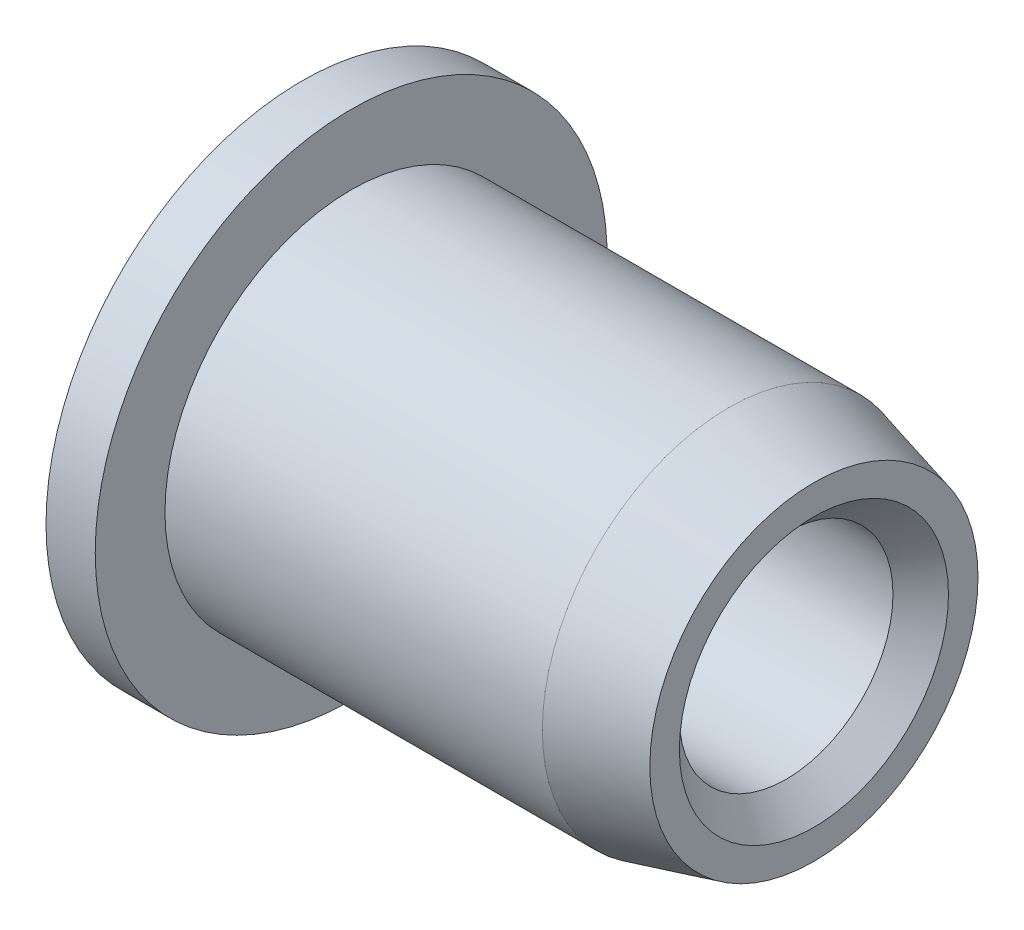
ISO-10303-21;
HEADER;
FILE_DESCRIPTION(('STEP AP214'),'2;1');
FILE_NAME('part.step','',(''),(''),'','','');
FILE_SCHEMA(('AUTOMOTIVE_DESIGN { 1 0 10303 214 1 1 1 1 }'));
ENDSEC;
DATA;
#1=APPLICATION_CONTEXT('core data for automotive mechanical design processes');
#2=APPLICATION_PROTOCOL_DEFINITION('international standard','automotive_design',2000,#1);
#3=PRODUCT_CONTEXT('',#1,'mechanical');
#4=PRODUCT('Part','Part','',(#3));
#5=PRODUCT_RELATED_PRODUCT_CATEGORY('part','',(#4));
#6=PRODUCT_DEFINITION_FORMATION('','',#4);
#7=PRODUCT_DEFINITION_CONTEXT('part definition',#1,'design');
#8=PRODUCT_DEFINITION('design','',#6,#7);
#9=PRODUCT_DEFINITION_SHAPE('','',#8);
#10=(LENGTH_UNIT() NAMED_UNIT(*) SI_UNIT(.MILLI.,.METRE.));
#11=(NAMED_UNIT(*) PLANE_ANGLE_UNIT() SI_UNIT($,.RADIAN.));
#12=(NAMED_UNIT(*) SI_UNIT($,.STERADIAN.) SOLID_ANGLE_UNIT());
#13=UNCERTAINTY_MEASURE_WITH_UNIT(LENGTH_MEASURE(1.E-05),#10,'distance_accuracy_value','');
#14=(GEOMETRIC_REPRESENTATION_CONTEXT(3) GLOBAL_UNCERTAINTY_ASSIGNED_CONTEXT((#13)) GLOBAL_UNIT_ASSIGNED_CONTEXT((#10,
#11,#12)) REPRESENTATION_CONTEXT('',''));
#15=CARTESIAN_POINT('',(0.,0.,0.));
#16=DIRECTION('',(0.,0.,1.));
#17=DIRECTION('',(1.,0.,0.));
#18=AXIS2_PLACEMENT_3D('',#15,#16,#17);
#19=CARTESIAN_POINT('',(7.49553999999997,0.,0.));
#20=DIRECTION('',(-1.,0.,0.));
#21=DIRECTION('',(0.,-1.,0.));
#22=AXIS2_PLACEMENT_3D('',#19,#20,#21);
#23=CYLINDRICAL_SURFACE('',#22,1.65354);
#24=CARTESIAN_POINT('',(0.429259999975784,0.,0.));
#25=DIRECTION('',(-1.,0.,0.));
#26=DIRECTION('',(0.,0.,1.));
#27=AXIS2_PLACEMENT_3D('',#24,#25,#26);
#28=CIRCLE('',#27,1.65354000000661);
#29=CARTESIAN_POINT('',(0.429259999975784,0.,1.65354000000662));
#30=VERTEX_POINT('',#29);
#31=EDGE_CURVE('E30',#30,#30,#28,.F.);
#32=ORIENTED_EDGE('',*,*,#31,.F.);
#33=EDGE_LOOP('',(#32));
#34=FACE_BOUND('',#33,.T.);
#35=CARTESIAN_POINT('',(7.49554000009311,0.,0.));
#36=DIRECTION('',(1.,0.,0.));
#37=DIRECTION('',(0.,0.,1.));
#38=AXIS2_PLACEMENT_3D('',#35,#36,#37);
#39=CIRCLE('',#38,1.65354000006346);
#40=CARTESIAN_POINT('',(7.49554000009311,0.,1.65354000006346));
#41=VERTEX_POINT('',#40);
#42=EDGE_CURVE('E44',#41,#41,#39,.F.);
#43=ORIENTED_EDGE('',*,*,#42,.F.);
#44=EDGE_LOOP('',(#43));
#45=FACE_BOUND('',#44,.T.);
#46=ADVANCED_FACE('F14',(#34,#45),#23,.F.);
#47=CARTESIAN_POINT('',(0.429260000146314,0.,0.));
#48=DIRECTION('',(-1.,0.,0.));
#49=DIRECTION('',(0.,-1.,0.));
#50=AXIS2_PLACEMENT_3D('',#47,#48,#49);
#51=CONICAL_SURFACE('',#50,1.65353999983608,0.785398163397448);
#52=ORIENTED_EDGE('',*,*,#31,.T.);
#53=EDGE_LOOP('',(#52));
#54=FACE_BOUND('',#53,.T.);
#55=CARTESIAN_POINT('',(5.6843418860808E-11,0.,0.));
#56=DIRECTION('',(-1.,0.,0.));
#57=DIRECTION('',(0.,-1.,0.));
#58=AXIS2_PLACEMENT_3D('',#55,#56,#57);
#59=CIRCLE('',#58,2.08279999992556);
#60=CARTESIAN_POINT('',(5.68436578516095E-11,-2.08279999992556,0.));
#61=VERTEX_POINT('',#60);
#62=EDGE_CURVE('E17',#61,#61,#59,.F.);
#63=ORIENTED_EDGE('',*,*,#62,.F.);
#64=EDGE_LOOP('',(#63));
#65=FACE_BOUND('',#64,.T.);
#66=ADVANCED_FACE('F53',(#54,#65),#51,.F.);
#67=CARTESIAN_POINT('',(7.49554000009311,0.,0.));
#68=DIRECTION('',(1.,0.,0.));
#69=DIRECTION('',(0.,0.,-1.));
#70=AXIS2_PLACEMENT_3D('',#67,#68,#69);
#71=CONICAL_SURFACE('',#70,1.65354000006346,0.785398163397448);
#72=ORIENTED_EDGE('',*,*,#42,.T.);
#73=EDGE_LOOP('',(#72));
#74=FACE_BOUND('',#73,.T.);
#75=CARTESIAN_POINT('',(7.9248000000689,0.,0.));
#76=DIRECTION('',(1.,0.,0.));
#77=DIRECTION('',(0.,0.,-1.));
#78=AXIS2_PLACEMENT_3D('',#75,#76,#77);
#79=CIRCLE('',#78,2.08280000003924);
#80=CARTESIAN_POINT('',(7.9248000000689,0.,-2.08280000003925));
#81=VERTEX_POINT('',#80);
#82=EDGE_CURVE('E39',#81,#81,#79,.F.);
#83=ORIENTED_EDGE('',*,*,#82,.F.);
#84=EDGE_LOOP('',(#83));
#85=FACE_BOUND('',#84,.T.);
#86=ADVANCED_FACE('F62',(#74,#85),#71,.F.);
#87=CARTESIAN_POINT('',(0.,0.,-1.98119999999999));
#88=DIRECTION('',(-1.,0.,0.));
#89=DIRECTION('',(0.,0.,1.));
#90=AXIS2_PLACEMENT_3D('',#87,#88,#89);
#91=PLANE('',#90);
#92=CARTESIAN_POINT('',(0.,0.,0.));
#93=DIRECTION('',(-1.,0.,0.));
#94=DIRECTION('',(0.,0.,1.));
#95=AXIS2_PLACEMENT_3D('',#92,#93,#94);
#96=CIRCLE('',#95,3.9624);
#97=CARTESIAN_POINT('',(0.,0.,3.96240000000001));
#98=VERTEX_POINT('',#97);
#99=EDGE_CURVE('E37',#98,#98,#96,.F.);
#100=ORIENTED_EDGE('',*,*,#99,.F.);
#101=EDGE_LOOP('',(#100));
#102=FACE_BOUND('',#101,.T.);
#103=ORIENTED_EDGE('',*,*,#62,.T.);
#104=EDGE_LOOP('',(#103));
#105=FACE_BOUND('',#104,.T.);
#106=ADVANCED_FACE('F85',(#102,#105),#91,.T.);
#107=CARTESIAN_POINT('',(7.92479999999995,0.,-1.27000000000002));
#108=DIRECTION('',(1.,0.,0.));
#109=DIRECTION('',(0.,1.,0.));
#110=AXIS2_PLACEMENT_3D('',#107,#108,#109);
#111=PLANE('',#110);
#112=CARTESIAN_POINT('',(7.9248000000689,0.,0.));
#113=DIRECTION('',(-1.,0.,0.));
#114=DIRECTION('',(0.,-1.,0.));
#115=AXIS2_PLACEMENT_3D('',#112,#113,#114);
#116=CIRCLE('',#115,2.53999999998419);
#117=CARTESIAN_POINT('',(7.9248000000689,-2.53999999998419,0.));
#118=VERTEX_POINT('',#117);
#119=EDGE_CURVE('E34',#118,#118,#116,.T.);
#120=ORIENTED_EDGE('',*,*,#119,.F.);
#121=EDGE_LOOP('',(#120));
#122=FACE_BOUND('',#121,.T.);
#123=ORIENTED_EDGE('',*,*,#82,.T.);
#124=EDGE_LOOP('',(#123));
#125=FACE_BOUND('',#124,.T.);
#126=ADVANCED_FACE('F81',(#122,#125),#111,.T.);
#127=CARTESIAN_POINT('',(0.380999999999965,0.,0.));
#128=DIRECTION('',(-1.,0.,0.));
#129=DIRECTION('',(0.,0.,1.));
#130=AXIS2_PLACEMENT_3D('',#127,#128,#129);
#131=CYLINDRICAL_SURFACE('',#130,3.9624);
#132=ORIENTED_EDGE('',*,*,#99,.T.);
#133=EDGE_LOOP('',(#132));
#134=FACE_BOUND('',#133,.T.);
#135=CARTESIAN_POINT('',(0.76200000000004,0.,0.));
#136=DIRECTION('',(-1.,0.,0.));
#137=DIRECTION('',(0.,0.,1.));
#138=AXIS2_PLACEMENT_3D('',#135,#136,#137);
#139=CIRCLE('',#138,3.9624);
#140=CARTESIAN_POINT('',(0.76200000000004,0.,3.96240000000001));
#141=VERTEX_POINT('',#140);
#142=EDGE_CURVE('E26',#141,#141,#139,.F.);
#143=ORIENTED_EDGE('',*,*,#142,.F.);
#144=EDGE_LOOP('',(#143));
#145=FACE_BOUND('',#144,.T.);
#146=ADVANCED_FACE('F77',(#134,#145),#131,.T.);
#147=CARTESIAN_POINT('',(6.60400000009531,0.,0.));
#148=DIRECTION('',(-1.,0.,0.));
#149=DIRECTION('',(0.,-1.,0.));
#150=AXIS2_PLACEMENT_3D('',#147,#148,#149);
#151=CONICAL_SURFACE('',#150,2.8828999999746,0.254007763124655);
#152=ORIENTED_EDGE('',*,*,#119,.T.);
#153=EDGE_LOOP('',(#152));
#154=FACE_BOUND('',#153,.T.);
#155=CARTESIAN_POINT('',(6.60400000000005,0.,0.));
#156=DIRECTION('',(-1.,0.,0.));
#157=DIRECTION('',(0.,0.,1.));
#158=AXIS2_PLACEMENT_3D('',#155,#156,#157);
#159=CIRCLE('',#158,2.8829);
#160=CARTESIAN_POINT('',(6.60400000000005,0.,2.88290000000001));
#161=VERTEX_POINT('',#160);
#162=EDGE_CURVE('E21',#161,#161,#159,.T.);
#163=ORIENTED_EDGE('',*,*,#162,.F.);
#164=EDGE_LOOP('',(#163));
#165=FACE_BOUND('',#164,.T.);
#166=ADVANCED_FACE('F71',(#154,#165),#151,.T.);
#167=CARTESIAN_POINT('',(0.76200000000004,0.,-3.42265));
#168=DIRECTION('',(1.,0.,0.));
#169=DIRECTION('',(0.,1.,0.));
#170=AXIS2_PLACEMENT_3D('',#167,#168,#169);
#171=PLANE('',#170);
#172=CARTESIAN_POINT('',(0.76200000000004,0.,0.));
#173=DIRECTION('',(-1.,0.,0.));
#174=DIRECTION('',(0.,0.,1.));
#175=AXIS2_PLACEMENT_3D('',#172,#173,#174);
#176=CIRCLE('',#175,2.8829);
#177=CARTESIAN_POINT('',(0.76200000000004,0.,2.88290000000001));
#178=VERTEX_POINT('',#177);
#179=EDGE_CURVE('E10',#178,#178,#176,.F.);
#180=ORIENTED_EDGE('',*,*,#179,.F.);
#181=EDGE_LOOP('',(#180));
#182=FACE_BOUND('',#181,.T.);
#183=ORIENTED_EDGE('',*,*,#142,.T.);
#184=EDGE_LOOP('',(#183));
#185=FACE_BOUND('',#184,.T.);
#186=ADVANCED_FACE('F65',(#182,#185),#171,.T.);
#187=CARTESIAN_POINT('',(3.68299999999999,0.,0.));
#188=DIRECTION('',(-1.,0.,0.));
#189=DIRECTION('',(0.,0.,1.));
#190=AXIS2_PLACEMENT_3D('',#187,#188,#189);
#191=CYLINDRICAL_SURFACE('',#190,2.8829);
#192=ORIENTED_EDGE('',*,*,#162,.T.);
#193=EDGE_LOOP('',(#192));
#194=FACE_BOUND('',#193,.T.);
#195=ORIENTED_EDGE('',*,*,#179,.T.);
#196=EDGE_LOOP('',(#195));
#197=FACE_BOUND('',#196,.T.);
#198=ADVANCED_FACE('F63',(#194,#197),#191,.T.);
#199=CLOSED_SHELL('',(#46,#66,#86,#106,#126,#146,#166,#186,#198));
#200=MANIFOLD_SOLID_BREP('B1',#199);
#201=ADVANCED_BREP_SHAPE_REPRESENTATION('',(#18,#200),#14);
#202=SHAPE_DEFINITION_REPRESENTATION(#9,#201);
ENDSEC;
END-ISO-10303-21;
